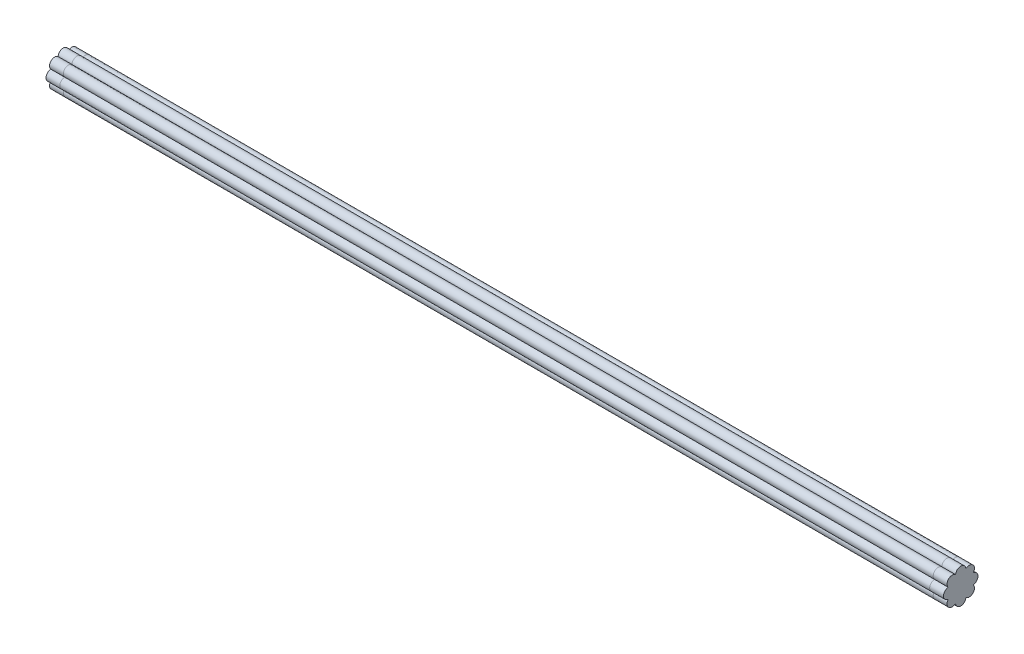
from build123d import *

# Parameters (mm, degrees)
SALIENTE_EXTRUIR1_DEPTH      = 630
SALIENTE_EXTRUIR1_DEPTH_BACK = 630
SALIENTE_EXTRUIR2_DEPTH      = 630
SALIENTE_EXTRUIR2_DEPTH_BACK = 630
CROQUIS3_R                   = 7.5
SALIENTE_EXTRUIR3_DEPTH      = 20


with BuildPart() as part:
    # Croquis2 → Saliente-Extruir1 (new, two sides: drawn at the far end of the back side and taken through both)
    with BuildSketch(Plane(origin=(0, 0, 0), x_dir=(0, 0, -1), z_dir=(1, 0, 0)).offset(-SALIENTE_EXTRUIR1_DEPTH_BACK)):
        with BuildLine():
            ThreePointArc((7.47931345, 18.056659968), (0, 25), (-7.47931345, 18.056659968))
            ThreePointArc((-7.47931345, 18.056659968), (-17.67766953, 17.67766953), (-18.056659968, 7.47931345))
            ThreePointArc((-18.056659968, 7.47931345), (-25, 0), (-18.056659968, -7.47931345))
            ThreePointArc((-18.056659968, -7.47931345), (-17.67766953, -17.67766953), (-7.47931345, -18.056659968))
            ThreePointArc((-7.47931345, -18.056659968), (0, -10), (7.47931345, -18.056659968))
            ThreePointArc((7.47931345, -18.056659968), (17.67766953, -17.67766953), (18.056659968, -7.47931345))
            ThreePointArc((18.056659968, -7.47931345), (25, 0), (18.056659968, 7.47931345))
            ThreePointArc((18.056659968, 7.47931345), (17.67766953, 17.67766953), (7.47931345, 18.056659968))
        make_face()
    extrude(amount=SALIENTE_EXTRUIR1_DEPTH + SALIENTE_EXTRUIR1_DEPTH_BACK)


with BuildPart() as body_2:
    # Croquis3 → Saliente-Extruir2 (new, two sides: drawn at the far end of the back side and taken through both)
    with BuildSketch(Plane(origin=(0, 0, 0), x_dir=(0, 0, -1), z_dir=(1, 0, 0)).offset(-SALIENTE_EXTRUIR2_DEPTH_BACK)):
        with Locations((0, -17.5)):
            Circle(CROQUIS3_R)
    extrude(amount=SALIENTE_EXTRUIR2_DEPTH + SALIENTE_EXTRUIR2_DEPTH_BACK)


with BuildPart() as body_3:
    # Croquis4 → Saliente-Extruir3 (new body)
    with BuildSketch(Plane.ZY.offset(630)):
        with BuildLine():
            ThreePointArc((-7.47931345, -18.056659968), (0, -25), (7.47931345, -18.056659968))
            ThreePointArc((7.47931345, -18.056659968), (17.67766953, -17.67766953), (18.056659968, -7.47931345))
            ThreePointArc((18.056659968, -7.47931345), (25, 0), (18.056659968, 7.47931345))
            ThreePointArc((18.056659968, 7.47931345), (17.67766953, 17.67766953), (7.47931345, 18.056659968))
            ThreePointArc((7.47931345, 18.056659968), (0, 25), (-7.47931345, 18.056659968))
            ThreePointArc((-7.47931345, 18.056659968), (-17.67766953, 17.67766953), (-18.056659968, 7.47931345))
            ThreePointArc((-18.056659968, 7.47931345), (-25, 0), (-18.056659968, -7.47931345))
            ThreePointArc((-18.056659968, -7.47931345), (-17.67766953, -17.67766953), (-7.47931345, -18.056659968))
        make_face()
    extrude(amount=SALIENTE_EXTRUIR3_DEPTH)


with BuildPart() as body_4:
    # Simetr_a2: mirrored copy
    add(body_3.part.mirror(Plane(origin=(0, 0, 0), x_dir=(0, 0, 1), z_dir=(1, 0, 0))))


solid = Compound([part.part, body_2.part, body_3.part, body_4.part])
